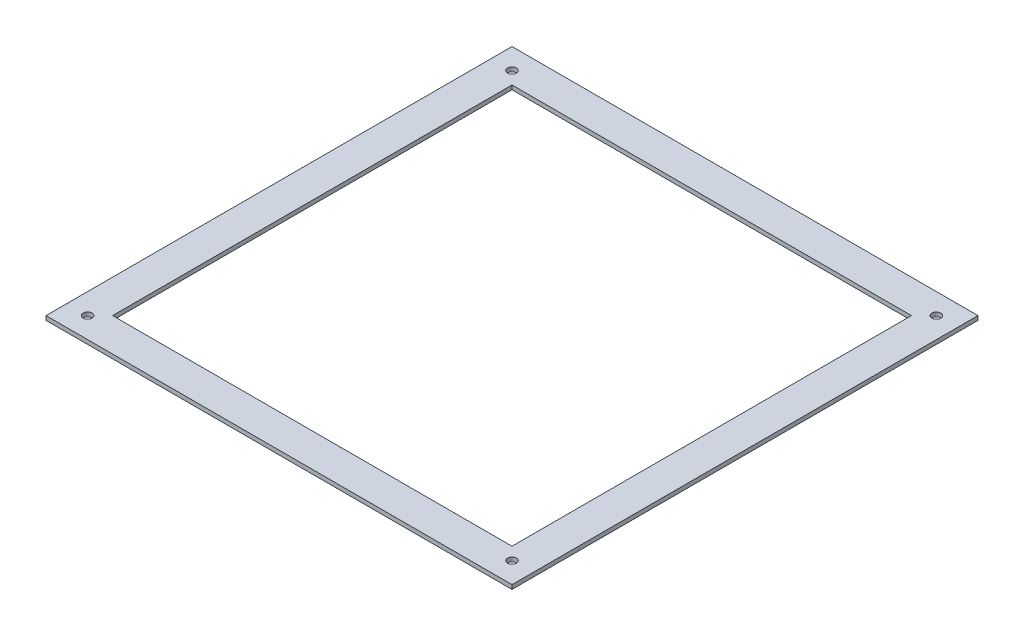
from build123d import *

# Parameters (mm, degrees)
SKETCH1_W                   = 355.6
SKETCH1_H                   = 355.6
SKETCH1_W_2                 = 304.8
SKETCH1_H_2                 = 304.8
BOSS_EXTRUDE1_DEPTH         = 3.175
F_1_4_CLEARANCE_HOLE2_D     = 6.7564
F_1_4_CLEARANCE_HOLE2_DEPTH = 6.35
F_1_4_CLEARANCE_HOLE2_TIP   = 2.029827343


with BuildPart() as part:
    # Sketch1 → Boss-Extrude1 (new body)
    with BuildSketch(Plane(origin=(0, 0, 0), x_dir=(1, 0, 0), z_dir=(0, 1, 0))):
        Rectangle(SKETCH1_W, SKETCH1_H)
        Rectangle(SKETCH1_W_2, SKETCH1_H_2, mode=Mode.SUBTRACT)
    extrude(amount=BOSS_EXTRUDE1_DEPTH)

    # 1_4 Clearance Hole2
    with Locations(Plane(origin=(0, 3.175, 0), x_dir=(-1, 0, 0), z_dir=(0, 1, 0))):
        with Locations((161.925, 161.925), (-161.925, 161.925), (-161.925, -161.925), (161.925, -161.925)):
            Hole(F_1_4_CLEARANCE_HOLE2_D / 2, depth=F_1_4_CLEARANCE_HOLE2_DEPTH)
            with Locations((0, 0, -(F_1_4_CLEARANCE_HOLE2_DEPTH + F_1_4_CLEARANCE_HOLE2_TIP / 2))):  # 118° drill point
                Cone(0, F_1_4_CLEARANCE_HOLE2_D / 2, F_1_4_CLEARANCE_HOLE2_TIP, mode=Mode.SUBTRACT)


solid = part.part
